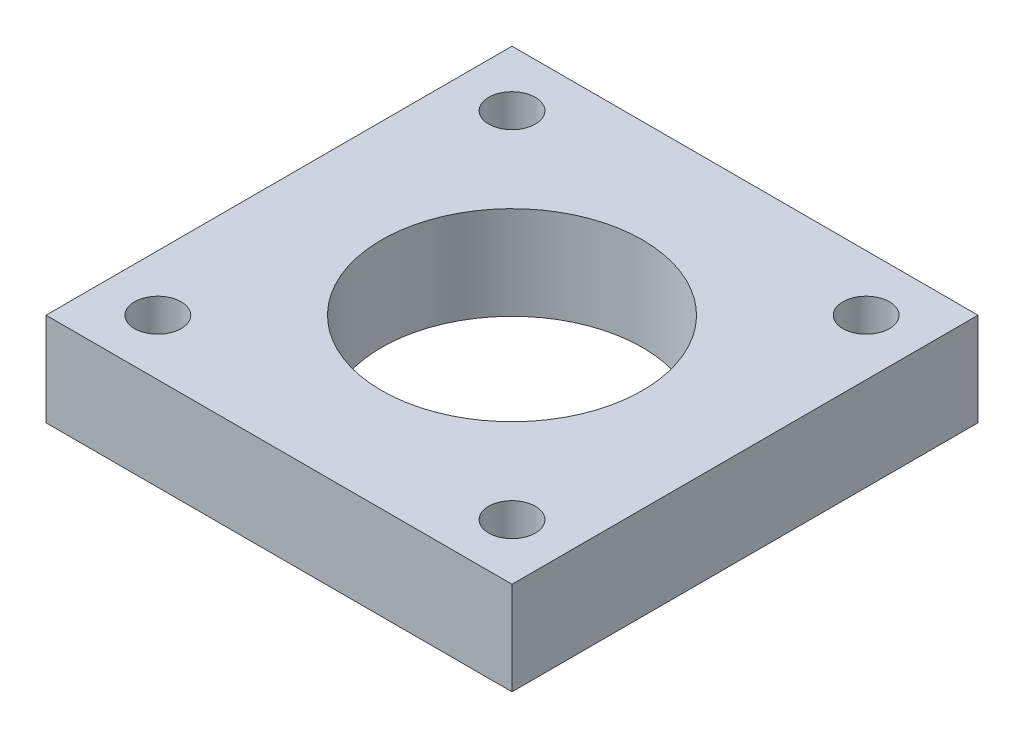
ISO-10303-21;
HEADER;
FILE_DESCRIPTION(('STEP AP214'),'2;1');
FILE_NAME('part.step','',(''),(''),'','','');
FILE_SCHEMA(('AUTOMOTIVE_DESIGN { 1 0 10303 214 1 1 1 1 }'));
ENDSEC;
DATA;
#1=APPLICATION_CONTEXT('core data for automotive mechanical design processes');
#2=APPLICATION_PROTOCOL_DEFINITION('international standard','automotive_design',2000,#1);
#3=PRODUCT_CONTEXT('',#1,'mechanical');
#4=PRODUCT('Part','Part','',(#3));
#5=PRODUCT_RELATED_PRODUCT_CATEGORY('part','',(#4));
#6=PRODUCT_DEFINITION_FORMATION('','',#4);
#7=PRODUCT_DEFINITION_CONTEXT('part definition',#1,'design');
#8=PRODUCT_DEFINITION('design','',#6,#7);
#9=PRODUCT_DEFINITION_SHAPE('','',#8);
#10=(LENGTH_UNIT() NAMED_UNIT(*) SI_UNIT(.MILLI.,.METRE.));
#11=(NAMED_UNIT(*) PLANE_ANGLE_UNIT() SI_UNIT($,.RADIAN.));
#12=(NAMED_UNIT(*) SI_UNIT($,.STERADIAN.) SOLID_ANGLE_UNIT());
#13=UNCERTAINTY_MEASURE_WITH_UNIT(LENGTH_MEASURE(1.E-05),#10,'distance_accuracy_value','');
#14=(GEOMETRIC_REPRESENTATION_CONTEXT(3) GLOBAL_UNCERTAINTY_ASSIGNED_CONTEXT((#13)) GLOBAL_UNIT_ASSIGNED_CONTEXT((#10,
#11,#12)) REPRESENTATION_CONTEXT('',''));
#15=CARTESIAN_POINT('',(0.,0.,0.));
#16=DIRECTION('',(0.,0.,1.));
#17=DIRECTION('',(1.,0.,0.));
#18=AXIS2_PLACEMENT_3D('',#15,#16,#17);
#19=CARTESIAN_POINT('',(-25.,10.,-25.));
#20=DIRECTION('',(1.,0.,0.));
#21=DIRECTION('',(0.,0.,-1.));
#22=AXIS2_PLACEMENT_3D('',#19,#20,#21);
#23=PLANE('',#22);
#24=DIRECTION('',(0.,0.,1.));
#25=VECTOR('',#24,1.);
#26=CARTESIAN_POINT('',(-25.,0.,-25.));
#27=LINE('',#26,#25);
#28=CARTESIAN_POINT('',(-25.,0.,-25.));
#29=VERTEX_POINT('',#28);
#30=CARTESIAN_POINT('',(-25.,0.,25.));
#31=VERTEX_POINT('',#30);
#32=EDGE_CURVE('E100',#29,#31,#27,.T.);
#33=ORIENTED_EDGE('',*,*,#32,.T.);
#34=DIRECTION('',(0.,-1.,0.));
#35=VECTOR('',#34,1.);
#36=CARTESIAN_POINT('',(-25.,10.,25.));
#37=LINE('',#36,#35);
#38=CARTESIAN_POINT('',(-25.,10.,25.));
#39=VERTEX_POINT('',#38);
#40=EDGE_CURVE('E11',#39,#31,#37,.T.);
#41=ORIENTED_EDGE('',*,*,#40,.F.);
#42=DIRECTION('',(0.,0.,1.));
#43=VECTOR('',#42,1.);
#44=CARTESIAN_POINT('',(-25.,10.,-25.));
#45=LINE('',#44,#43);
#46=CARTESIAN_POINT('',(-25.,10.,-25.));
#47=VERTEX_POINT('',#46);
#48=EDGE_CURVE('E88',#47,#39,#45,.T.);
#49=ORIENTED_EDGE('',*,*,#48,.F.);
#50=DIRECTION('',(0.,-1.,0.));
#51=VECTOR('',#50,1.);
#52=CARTESIAN_POINT('',(-25.,10.,-25.));
#53=LINE('',#52,#51);
#54=EDGE_CURVE('E96',#47,#29,#53,.T.);
#55=ORIENTED_EDGE('',*,*,#54,.T.);
#56=EDGE_LOOP('',(#33,#41,#49,#55));
#57=FACE_BOUND('',#56,.T.);
#58=ADVANCED_FACE('F37',(#57),#23,.F.);
#59=CARTESIAN_POINT('',(25.,10.,25.));
#60=DIRECTION('',(0.,0.,-1.));
#61=DIRECTION('',(-1.,0.,0.));
#62=AXIS2_PLACEMENT_3D('',#59,#60,#61);
#63=PLANE('',#62);
#64=DIRECTION('',(1.,0.,0.));
#65=VECTOR('',#64,1.);
#66=CARTESIAN_POINT('',(25.,0.,25.));
#67=LINE('',#66,#65);
#68=CARTESIAN_POINT('',(25.,0.,25.));
#69=VERTEX_POINT('',#68);
#70=EDGE_CURVE('E92',#31,#69,#67,.T.);
#71=ORIENTED_EDGE('',*,*,#70,.T.);
#72=DIRECTION('',(0.,-1.,0.));
#73=VECTOR('',#72,1.);
#74=CARTESIAN_POINT('',(25.,10.,25.));
#75=LINE('',#74,#73);
#76=CARTESIAN_POINT('',(25.,10.,25.));
#77=VERTEX_POINT('',#76);
#78=EDGE_CURVE('E45',#77,#69,#75,.T.);
#79=ORIENTED_EDGE('',*,*,#78,.F.);
#80=DIRECTION('',(1.,0.,0.));
#81=VECTOR('',#80,1.);
#82=CARTESIAN_POINT('',(25.,10.,25.));
#83=LINE('',#82,#81);
#84=EDGE_CURVE('E83',#39,#77,#83,.T.);
#85=ORIENTED_EDGE('',*,*,#84,.F.);
#86=ORIENTED_EDGE('',*,*,#40,.T.);
#87=EDGE_LOOP('',(#71,#79,#85,#86));
#88=FACE_BOUND('',#87,.T.);
#89=ADVANCED_FACE('F91',(#88),#63,.F.);
#90=CARTESIAN_POINT('',(25.,10.,-25.));
#91=DIRECTION('',(-1.,0.,0.));
#92=DIRECTION('',(0.,0.,1.));
#93=AXIS2_PLACEMENT_3D('',#90,#91,#92);
#94=PLANE('',#93);
#95=DIRECTION('',(0.,0.,-1.));
#96=VECTOR('',#95,1.);
#97=CARTESIAN_POINT('',(25.,0.,-25.));
#98=LINE('',#97,#96);
#99=CARTESIAN_POINT('',(25.,0.,-25.));
#100=VERTEX_POINT('',#99);
#101=EDGE_CURVE('E70',#69,#100,#98,.T.);
#102=ORIENTED_EDGE('',*,*,#101,.T.);
#103=DIRECTION('',(0.,-1.,0.));
#104=VECTOR('',#103,1.);
#105=CARTESIAN_POINT('',(25.,10.,-25.));
#106=LINE('',#105,#104);
#107=CARTESIAN_POINT('',(25.,10.,-25.));
#108=VERTEX_POINT('',#107);
#109=EDGE_CURVE('E93',#108,#100,#106,.T.);
#110=ORIENTED_EDGE('',*,*,#109,.F.);
#111=DIRECTION('',(0.,0.,-1.));
#112=VECTOR('',#111,1.);
#113=CARTESIAN_POINT('',(25.,10.,-25.));
#114=LINE('',#113,#112);
#115=EDGE_CURVE('E86',#77,#108,#114,.T.);
#116=ORIENTED_EDGE('',*,*,#115,.F.);
#117=ORIENTED_EDGE('',*,*,#78,.T.);
#118=EDGE_LOOP('',(#102,#110,#116,#117));
#119=FACE_BOUND('',#118,.T.);
#120=ADVANCED_FACE('F94',(#119),#94,.F.);
#121=CARTESIAN_POINT('',(25.,10.,-25.));
#122=DIRECTION('',(0.,0.,1.));
#123=DIRECTION('',(1.,0.,0.));
#124=AXIS2_PLACEMENT_3D('',#121,#122,#123);
#125=PLANE('',#124);
#126=DIRECTION('',(-1.,0.,0.));
#127=VECTOR('',#126,1.);
#128=CARTESIAN_POINT('',(25.,0.,-25.));
#129=LINE('',#128,#127);
#130=EDGE_CURVE('E76',#100,#29,#129,.T.);
#131=ORIENTED_EDGE('',*,*,#130,.T.);
#132=ORIENTED_EDGE('',*,*,#54,.F.);
#133=DIRECTION('',(-1.,0.,0.));
#134=VECTOR('',#133,1.);
#135=CARTESIAN_POINT('',(25.,10.,-25.));
#136=LINE('',#135,#134);
#137=EDGE_CURVE('E53',#108,#47,#136,.T.);
#138=ORIENTED_EDGE('',*,*,#137,.F.);
#139=ORIENTED_EDGE('',*,*,#109,.T.);
#140=EDGE_LOOP('',(#131,#132,#138,#139));
#141=FACE_BOUND('',#140,.T.);
#142=ADVANCED_FACE('F108',(#141),#125,.F.);
#143=CARTESIAN_POINT('',(0.,10.,0.));
#144=DIRECTION('',(0.,-1.,0.));
#145=DIRECTION('',(0.,0.,-1.));
#146=AXIS2_PLACEMENT_3D('',#143,#144,#145);
#147=PLANE('',#146);
#148=CARTESIAN_POINT('',(0.,10.,0.));
#149=DIRECTION('',(0.,1.,0.));
#150=DIRECTION('',(0.,0.,1.));
#151=AXIS2_PLACEMENT_3D('',#148,#149,#150);
#152=CIRCLE('',#151,14.);
#153=CARTESIAN_POINT('',(0.,10.,14.));
#154=VERTEX_POINT('',#153);
#155=EDGE_CURVE('E140',#154,#154,#152,.T.);
#156=ORIENTED_EDGE('',*,*,#155,.F.);
#157=EDGE_LOOP('',(#156));
#158=FACE_BOUND('',#157,.T.);
#159=CARTESIAN_POINT('',(-19.,10.,-19.));
#160=DIRECTION('',(0.,1.,0.));
#161=DIRECTION('',(0.,0.,1.));
#162=AXIS2_PLACEMENT_3D('',#159,#160,#161);
#163=CIRCLE('',#162,2.49999999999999);
#164=CARTESIAN_POINT('',(-19.,10.,-16.5));
#165=VERTEX_POINT('',#164);
#166=EDGE_CURVE('E134',#165,#165,#163,.T.);
#167=ORIENTED_EDGE('',*,*,#166,.F.);
#168=EDGE_LOOP('',(#167));
#169=FACE_BOUND('',#168,.T.);
#170=CARTESIAN_POINT('',(19.,10.,-19.));
#171=DIRECTION('',(0.,1.,0.));
#172=DIRECTION('',(0.,0.,1.));
#173=AXIS2_PLACEMENT_3D('',#170,#171,#172);
#174=CIRCLE('',#173,2.49999999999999);
#175=CARTESIAN_POINT('',(19.,10.,-16.5));
#176=VERTEX_POINT('',#175);
#177=EDGE_CURVE('E128',#176,#176,#174,.T.);
#178=ORIENTED_EDGE('',*,*,#177,.F.);
#179=EDGE_LOOP('',(#178));
#180=FACE_BOUND('',#179,.T.);
#181=CARTESIAN_POINT('',(19.,10.,19.));
#182=DIRECTION('',(0.,1.,0.));
#183=DIRECTION('',(0.,0.,1.));
#184=AXIS2_PLACEMENT_3D('',#181,#182,#183);
#185=CIRCLE('',#184,2.49999999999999);
#186=CARTESIAN_POINT('',(19.,10.,21.5));
#187=VERTEX_POINT('',#186);
#188=EDGE_CURVE('E122',#187,#187,#185,.T.);
#189=ORIENTED_EDGE('',*,*,#188,.F.);
#190=EDGE_LOOP('',(#189));
#191=FACE_BOUND('',#190,.T.);
#192=CARTESIAN_POINT('',(-19.,10.,19.));
#193=DIRECTION('',(0.,1.,0.));
#194=DIRECTION('',(0.,0.,1.));
#195=AXIS2_PLACEMENT_3D('',#192,#193,#194);
#196=CIRCLE('',#195,2.49999999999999);
#197=CARTESIAN_POINT('',(-19.,10.,21.5));
#198=VERTEX_POINT('',#197);
#199=EDGE_CURVE('E116',#198,#198,#196,.T.);
#200=ORIENTED_EDGE('',*,*,#199,.F.);
#201=EDGE_LOOP('',(#200));
#202=FACE_BOUND('',#201,.T.);
#203=ORIENTED_EDGE('',*,*,#48,.T.);
#204=ORIENTED_EDGE('',*,*,#84,.T.);
#205=ORIENTED_EDGE('',*,*,#115,.T.);
#206=ORIENTED_EDGE('',*,*,#137,.T.);
#207=EDGE_LOOP('',(#203,#204,#205,#206));
#208=FACE_BOUND('',#207,.T.);
#209=ADVANCED_FACE('F84',(#158,#169,#180,#191,#202,#208),#147,.F.);
#210=CARTESIAN_POINT('',(0.,0.,0.));
#211=DIRECTION('',(0.,-1.,0.));
#212=DIRECTION('',(0.,0.,-1.));
#213=AXIS2_PLACEMENT_3D('',#210,#211,#212);
#214=PLANE('',#213);
#215=CARTESIAN_POINT('',(0.,0.,0.));
#216=DIRECTION('',(0.,1.,0.));
#217=DIRECTION('',(0.,0.,1.));
#218=AXIS2_PLACEMENT_3D('',#215,#216,#217);
#219=CIRCLE('',#218,14.);
#220=CARTESIAN_POINT('',(0.,0.,14.));
#221=VERTEX_POINT('',#220);
#222=EDGE_CURVE('E137',#221,#221,#219,.T.);
#223=ORIENTED_EDGE('',*,*,#222,.T.);
#224=EDGE_LOOP('',(#223));
#225=FACE_BOUND('',#224,.T.);
#226=CARTESIAN_POINT('',(-19.,0.,-19.));
#227=DIRECTION('',(0.,1.,0.));
#228=DIRECTION('',(0.,0.,1.));
#229=AXIS2_PLACEMENT_3D('',#226,#227,#228);
#230=CIRCLE('',#229,2.5);
#231=CARTESIAN_POINT('',(-19.,0.,-16.5));
#232=VERTEX_POINT('',#231);
#233=EDGE_CURVE('E131',#232,#232,#230,.T.);
#234=ORIENTED_EDGE('',*,*,#233,.T.);
#235=EDGE_LOOP('',(#234));
#236=FACE_BOUND('',#235,.T.);
#237=CARTESIAN_POINT('',(19.,0.,-19.));
#238=DIRECTION('',(0.,1.,0.));
#239=DIRECTION('',(0.,0.,1.));
#240=AXIS2_PLACEMENT_3D('',#237,#238,#239);
#241=CIRCLE('',#240,2.5);
#242=CARTESIAN_POINT('',(19.,0.,-16.5));
#243=VERTEX_POINT('',#242);
#244=EDGE_CURVE('E125',#243,#243,#241,.T.);
#245=ORIENTED_EDGE('',*,*,#244,.T.);
#246=EDGE_LOOP('',(#245));
#247=FACE_BOUND('',#246,.T.);
#248=CARTESIAN_POINT('',(19.,0.,19.));
#249=DIRECTION('',(0.,1.,0.));
#250=DIRECTION('',(0.,0.,1.));
#251=AXIS2_PLACEMENT_3D('',#248,#249,#250);
#252=CIRCLE('',#251,2.5);
#253=CARTESIAN_POINT('',(19.,0.,21.5));
#254=VERTEX_POINT('',#253);
#255=EDGE_CURVE('E119',#254,#254,#252,.T.);
#256=ORIENTED_EDGE('',*,*,#255,.T.);
#257=EDGE_LOOP('',(#256));
#258=FACE_BOUND('',#257,.T.);
#259=CARTESIAN_POINT('',(-19.,0.,19.));
#260=DIRECTION('',(0.,1.,0.));
#261=DIRECTION('',(0.,0.,1.));
#262=AXIS2_PLACEMENT_3D('',#259,#260,#261);
#263=CIRCLE('',#262,2.5);
#264=CARTESIAN_POINT('',(-19.,0.,21.5));
#265=VERTEX_POINT('',#264);
#266=EDGE_CURVE('E103',#265,#265,#263,.T.);
#267=ORIENTED_EDGE('',*,*,#266,.T.);
#268=EDGE_LOOP('',(#267));
#269=FACE_BOUND('',#268,.T.);
#270=ORIENTED_EDGE('',*,*,#32,.F.);
#271=ORIENTED_EDGE('',*,*,#130,.F.);
#272=ORIENTED_EDGE('',*,*,#101,.F.);
#273=ORIENTED_EDGE('',*,*,#70,.F.);
#274=EDGE_LOOP('',(#270,#271,#272,#273));
#275=FACE_BOUND('',#274,.T.);
#276=ADVANCED_FACE('F111',(#225,#236,#247,#258,#269,#275),#214,.T.);
#277=CARTESIAN_POINT('',(-19.,10.,19.));
#278=DIRECTION('',(0.,1.,0.));
#279=DIRECTION('',(0.,0.,1.));
#280=AXIS2_PLACEMENT_3D('',#277,#278,#279);
#281=CYLINDRICAL_SURFACE('',#280,2.49999999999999);
#282=ORIENTED_EDGE('',*,*,#266,.F.);
#283=EDGE_LOOP('',(#282));
#284=FACE_BOUND('',#283,.T.);
#285=ORIENTED_EDGE('',*,*,#199,.T.);
#286=EDGE_LOOP('',(#285));
#287=FACE_BOUND('',#286,.T.);
#288=ADVANCED_FACE('F157',(#284,#287),#281,.F.);
#289=CARTESIAN_POINT('',(19.,10.,19.));
#290=DIRECTION('',(0.,1.,0.));
#291=DIRECTION('',(0.,0.,1.));
#292=AXIS2_PLACEMENT_3D('',#289,#290,#291);
#293=CYLINDRICAL_SURFACE('',#292,2.5);
#294=ORIENTED_EDGE('',*,*,#255,.F.);
#295=EDGE_LOOP('',(#294));
#296=FACE_BOUND('',#295,.T.);
#297=ORIENTED_EDGE('',*,*,#188,.T.);
#298=EDGE_LOOP('',(#297));
#299=FACE_BOUND('',#298,.T.);
#300=ADVANCED_FACE('F159',(#296,#299),#293,.F.);
#301=CARTESIAN_POINT('',(19.,10.,-19.));
#302=DIRECTION('',(0.,1.,0.));
#303=DIRECTION('',(0.,0.,1.));
#304=AXIS2_PLACEMENT_3D('',#301,#302,#303);
#305=CYLINDRICAL_SURFACE('',#304,2.5);
#306=ORIENTED_EDGE('',*,*,#244,.F.);
#307=EDGE_LOOP('',(#306));
#308=FACE_BOUND('',#307,.T.);
#309=ORIENTED_EDGE('',*,*,#177,.T.);
#310=EDGE_LOOP('',(#309));
#311=FACE_BOUND('',#310,.T.);
#312=ADVANCED_FACE('F166',(#308,#311),#305,.F.);
#313=CARTESIAN_POINT('',(-19.,10.,-19.));
#314=DIRECTION('',(0.,1.,0.));
#315=DIRECTION('',(0.,0.,1.));
#316=AXIS2_PLACEMENT_3D('',#313,#314,#315);
#317=CYLINDRICAL_SURFACE('',#316,2.5);
#318=ORIENTED_EDGE('',*,*,#233,.F.);
#319=EDGE_LOOP('',(#318));
#320=FACE_BOUND('',#319,.T.);
#321=ORIENTED_EDGE('',*,*,#166,.T.);
#322=EDGE_LOOP('',(#321));
#323=FACE_BOUND('',#322,.T.);
#324=ADVANCED_FACE('F206',(#320,#323),#317,.F.);
#325=CARTESIAN_POINT('',(0.,10.,0.));
#326=DIRECTION('',(0.,1.,0.));
#327=DIRECTION('',(0.,0.,1.));
#328=AXIS2_PLACEMENT_3D('',#325,#326,#327);
#329=CYLINDRICAL_SURFACE('',#328,14.);
#330=ORIENTED_EDGE('',*,*,#222,.F.);
#331=EDGE_LOOP('',(#330));
#332=FACE_BOUND('',#331,.T.);
#333=ORIENTED_EDGE('',*,*,#155,.T.);
#334=EDGE_LOOP('',(#333));
#335=FACE_BOUND('',#334,.T.);
#336=ADVANCED_FACE('F144',(#332,#335),#329,.F.);
#337=CLOSED_SHELL('',(#58,#89,#120,#142,#209,#276,#288,#300,#312,#324,#336));
#338=MANIFOLD_SOLID_BREP('B2',#337);
#339=ADVANCED_BREP_SHAPE_REPRESENTATION('',(#18,#338),#14);
#340=SHAPE_DEFINITION_REPRESENTATION(#9,#339);
ENDSEC;
END-ISO-10303-21;
